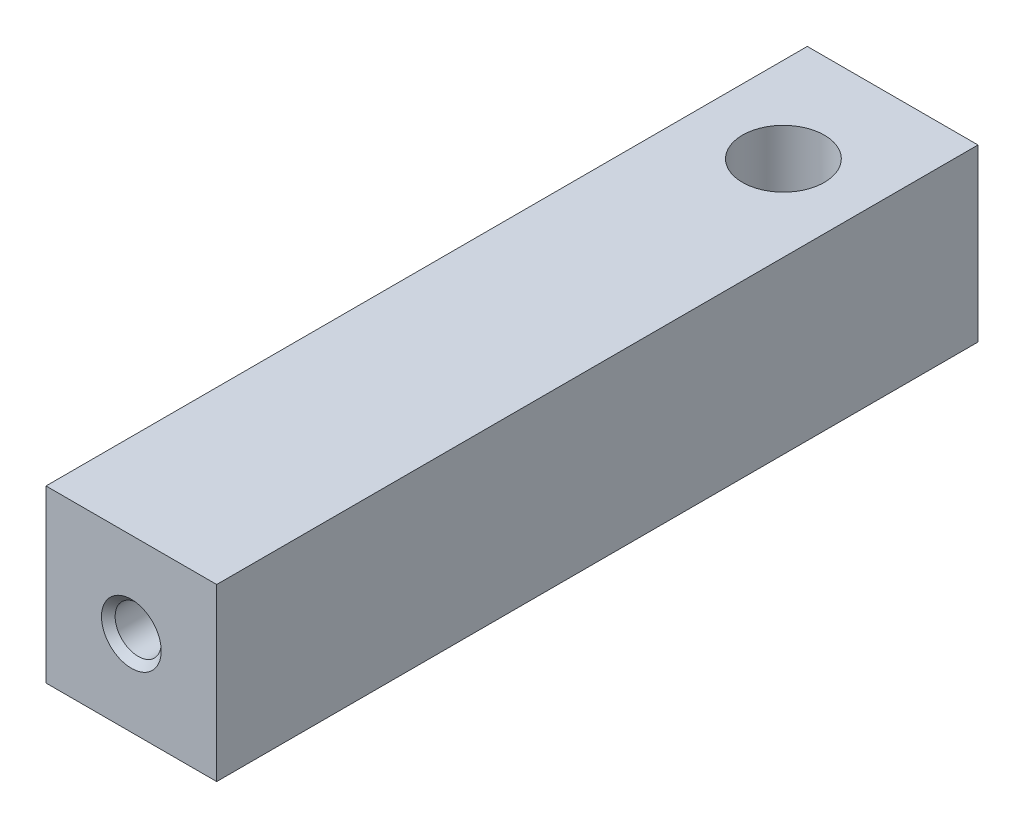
from build123d import *

# Parameters (mm, degrees)
ESQUISSE1_W                          = 25
ESQUISSE1_H                          = 25
BASE_EXTRUSION_DEPTH                 = 111.5
DIAM_TRE_DU_PER_AGE_6_7_6_75_1_D     = 6.75
DIAM_TRE_DU_PER_AGE_6_7_6_75_1_DEPTH = 21.75
DIAM_TRE_DU_PER_AGE_6_7_6_75_1_TIP   = 2.027904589
ENL_V_MAT_EXTRU_1_REACH              = 116.95
ESQUISSE4_R                          = 6
CHANFREIN1_SIZE                      = 1


with BuildPart() as part:
    # Esquisse1 → Base-Extrusion (new body)
    with BuildSketch(Plane.XY):
        Rectangle(ESQUISSE1_W, ESQUISSE1_H)
    extrude(amount=BASE_EXTRUSION_DEPTH)

    # Diam_tre du per_age _6.7 _6.75_1
    with Locations(Plane.XY.offset(111.5)):
        with Locations((0, 0)):
            Hole(DIAM_TRE_DU_PER_AGE_6_7_6_75_1_D / 2, depth=DIAM_TRE_DU_PER_AGE_6_7_6_75_1_DEPTH)
            with Locations((0, 0, -(DIAM_TRE_DU_PER_AGE_6_7_6_75_1_DEPTH + DIAM_TRE_DU_PER_AGE_6_7_6_75_1_TIP / 2))):  # 118° drill point
                Cone(0, DIAM_TRE_DU_PER_AGE_6_7_6_75_1_D / 2, DIAM_TRE_DU_PER_AGE_6_7_6_75_1_TIP, mode=Mode.SUBTRACT)

    # Esquisse4 → Enl_v. mat.-Extru.1 (cut, up to next)
    with BuildSketch(Plane(origin=(0, 12.5, 0), x_dir=(-1, 0, 0), z_dir=(0, 1, 0)), mode=Mode.PRIVATE) as enl_v_mat_extru_1_sk1:
        with Locations((0, 16)):
            Circle(ESQUISSE4_R)
    enl_v_mat_extru_1_tool1 = extrude(enl_v_mat_extru_1_sk1.sketch, amount=-ENL_V_MAT_EXTRU_1_REACH, mode=Mode.PRIVATE) & part.part
    add(enl_v_mat_extru_1_tool1.solids().sort_by_distance((0, 12.5, 16))[0], mode=Mode.SUBTRACT)

    # Chanfrein1
    chanfrein1_edges = [part.edges().sort_by_distance(p)[0] for p in [
        (3.375, 0, 111.5),
    ]]
    chamfer(chanfrein1_edges, length=CHANFREIN1_SIZE)


solid = part.part
